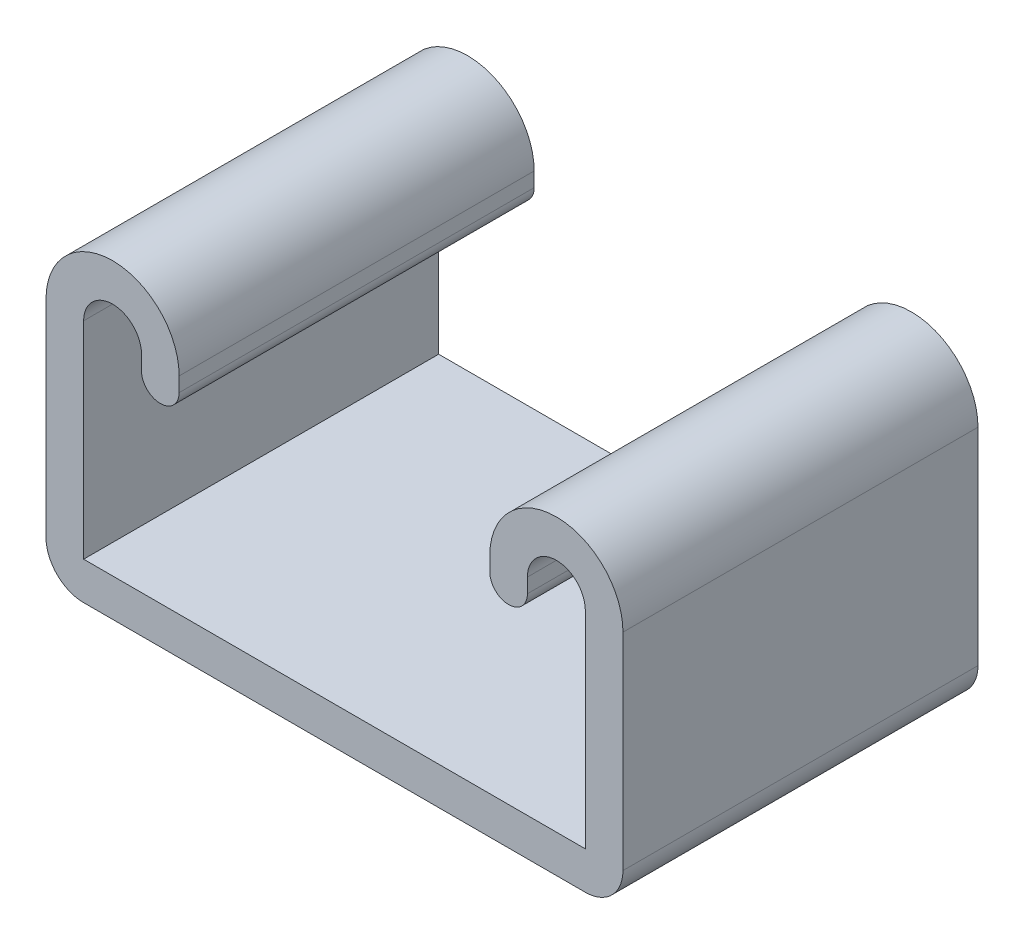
from build123d import *

# Parameters (mm, degrees)
BASE_EXTRUDE_DEPTH = 12.7


with BuildPart() as part:
    # Sketch1 → Base-Extrude (new, symmetric)
    with BuildSketch(Plane.XY):
        with BuildLine():
            Line((-20.6375, 8.3693), (-20.6375, -6.4008))
            ThreePointArc((-20.6375, -6.4008), (-19.848914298, -8.304614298), (-17.9451, -9.0932))
            Line((-17.9451, -9.0932), (17.9451, -9.0932))
            ThreePointArc((17.9451, -9.0932), (19.848914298, -8.304614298), (20.6375, -6.4008))
            Line((20.6375, -6.4008), (20.6375, 8.3693))
            ThreePointArc((20.6375, 8.3693), (15.875, 13.1318), (11.1125, 8.3693))
            Line((11.1125, 8.3693), (11.1125, 7.33425))
            ThreePointArc((11.1125, 7.33425), (12.4587, 5.98805), (13.8049, 7.33425))
            Line((13.8049, 7.33425), (13.8049, 8.3693))
            ThreePointArc((13.8049, 8.3693), (15.875, 10.4394), (17.9451, 8.3693))
            Line((17.9451, 8.3693), (17.9451, -6.4008))
            Line((17.9451, -6.4008), (-17.9451, -6.4008))
            Line((-17.9451, -6.4008), (-17.9451, 8.3693))
            ThreePointArc((-17.9451, 8.3693), (-15.875, 10.4394), (-13.8049, 8.3693))
            Line((-13.8049, 8.3693), (-13.8049, 7.33425))
            ThreePointArc((-13.8049, 7.33425), (-12.4587, 5.98805), (-11.1125, 7.33425))
            Line((-11.1125, 7.33425), (-11.1125, 8.3693))
            ThreePointArc((-11.1125, 8.3693), (-15.875, 13.1318), (-20.6375, 8.3693))
        make_face()
    extrude(amount=BASE_EXTRUDE_DEPTH, both=True)


solid = part.part
